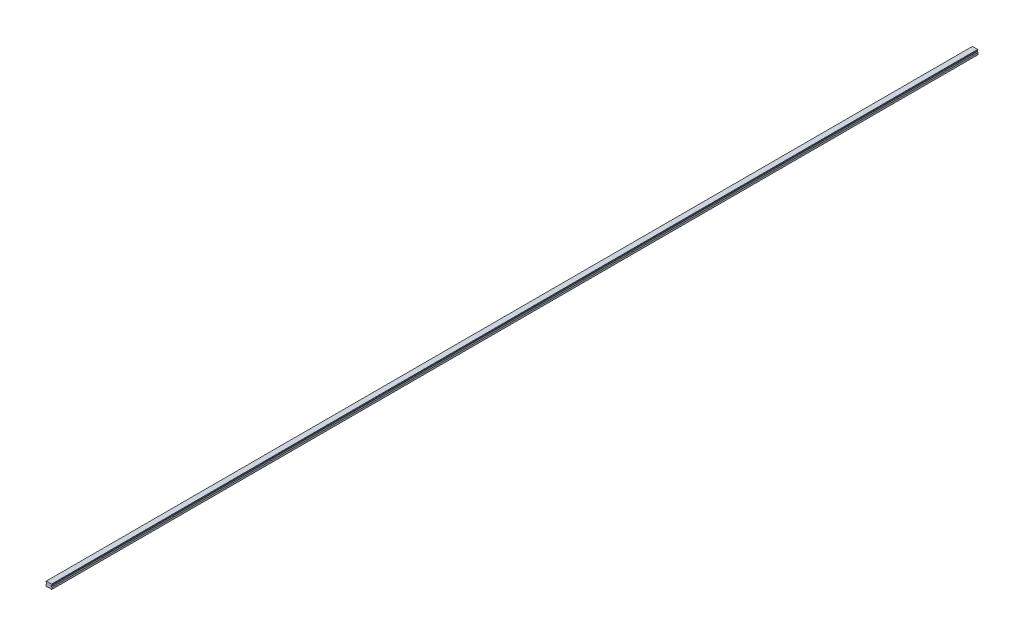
from build123d import *

# Parameters (mm, degrees)
SKETCH1_W           = 20
SKETCH1_H           = 16.3
BOSS_EXTRUDE1_DEPTH = 1580
CUT_EXTRUDE1_DEPTH  = 3161.057861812
CHAMFER1_SIZE       = 1
FILLET1_R           = 1
CUT_EXTRUDE2_DEPTH  = 3161.057861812
SKETCH5_R           = 3
SKETCH5_R_2         = 2.5
CUT_EXTRUDE5_DEPTH  = 10
SKETCH5_2_R         = 2.5
CUT_EXTRUDE6_DEPTH  = 13
LPATTERN2_COUNT     = 53
LPATTERN2_PITCH     = 60


with BuildPart() as part:
    # Sketch1 → Boss-Extrude1 (new, symmetric)
    with BuildSketch(Plane.XY):
        with Locations((0, 8.15)):
            Rectangle(SKETCH1_W, SKETCH1_H)
    extrude(amount=BOSS_EXTRUDE1_DEPTH, both=True)

    # Sketch2 → Cut-Extrude1 (cut, through all)
    with BuildSketch(Plane.XY.offset(1580)):
        Polygon((-10, 14.3), (-10, 7.3), (-7.666666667, 9.633333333), (-7.666666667, 11.966666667), align=None)
        Polygon((7.666666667, 11.966666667), (10, 14.3), (10, 7.3), (7.666666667, 9.633333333), align=None)
    extrude(amount=-CUT_EXTRUDE1_DEPTH, mode=Mode.SUBTRACT)

    # Chamfer1
    chamfer1_edges = [part.edges().sort_by_distance(p)[0] for p in [
        (-10, 16.3, 0),
        (10, 16.3, 0),
        (10, 0, 0),
        (-10, 0, 0),
    ]]
    chamfer(chamfer1_edges, length=CHAMFER1_SIZE)

    # Fillet1
    fillet1_edges = [part.edges().sort_by_distance(p)[0] for p in [
        (-7.666666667, 11.966666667, 0),
        (-7.666666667, 9.633333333, 0),
        (7.666666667, 9.633333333, 0),
        (7.666666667, 11.966666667, 0),
    ]]
    fillet(fillet1_edges, radius=FILLET1_R)

    # Sketch3 → Cut-Extrude2 (cut, through all)
    with BuildSketch(Plane.XY.offset(1580)):
        Polygon((-6, 0), (-5, 1), (5, 1), (6, 0), align=None)
    extrude(amount=-CUT_EXTRUDE2_DEPTH, mode=Mode.SUBTRACT)

    # Sketch5 → Cut-Extrude5 (cut)
    with BuildSketch(Plane.XZ.offset(-1)):
        with Locations(Location((0, 1560, 0), (0, 0, 270))):
            Circle(SKETCH5_R)
        with Locations(Location((0, 1560, 0), (0, 0, 270))):
            Circle(SKETCH5_R_2, mode=Mode.SUBTRACT)
    cut_extrude5 = extrude(amount=-CUT_EXTRUDE5_DEPTH, mode=Mode.SUBTRACT)

    # Sketch5_2 → Cut-Extrude6 (cut)
    with BuildSketch(Plane.XZ.offset(-1)):
        with Locations(Location((0, 1560, 0), (0, 0, 270))):
            Circle(SKETCH5_2_R)
    cut_extrude6 = extrude(amount=-CUT_EXTRUDE6_DEPTH, mode=Mode.SUBTRACT)

    # Cut-Extrude7 cone 1 section (on through the dimple's axis) → Cut-Extrude7 (revolve, cut)
    with BuildSketch(Plane(origin=(0, 14, 1560), x_dir=(0, 0, -1), z_dir=(1, 0, 0))):
        Polygon((0, 0), (2.5, 0), (0, 1.443375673), align=None)
    cut_extrude7 = revolve(axis=Axis((0, 14, 1560), (0, 1, 0)), mode=Mode.SUBTRACT)

    # LPattern2: Cut-Extrude5, Cut-Extrude6, Cut-Extrude7 ×53
    with Locations(*[(0, 0, -i * LPATTERN2_PITCH) for i in range(1, LPATTERN2_COUNT)]):
        add(cut_extrude5, mode=Mode.SUBTRACT)
        add(cut_extrude6, mode=Mode.SUBTRACT)
        add(cut_extrude7, mode=Mode.SUBTRACT)


solid = part.part
